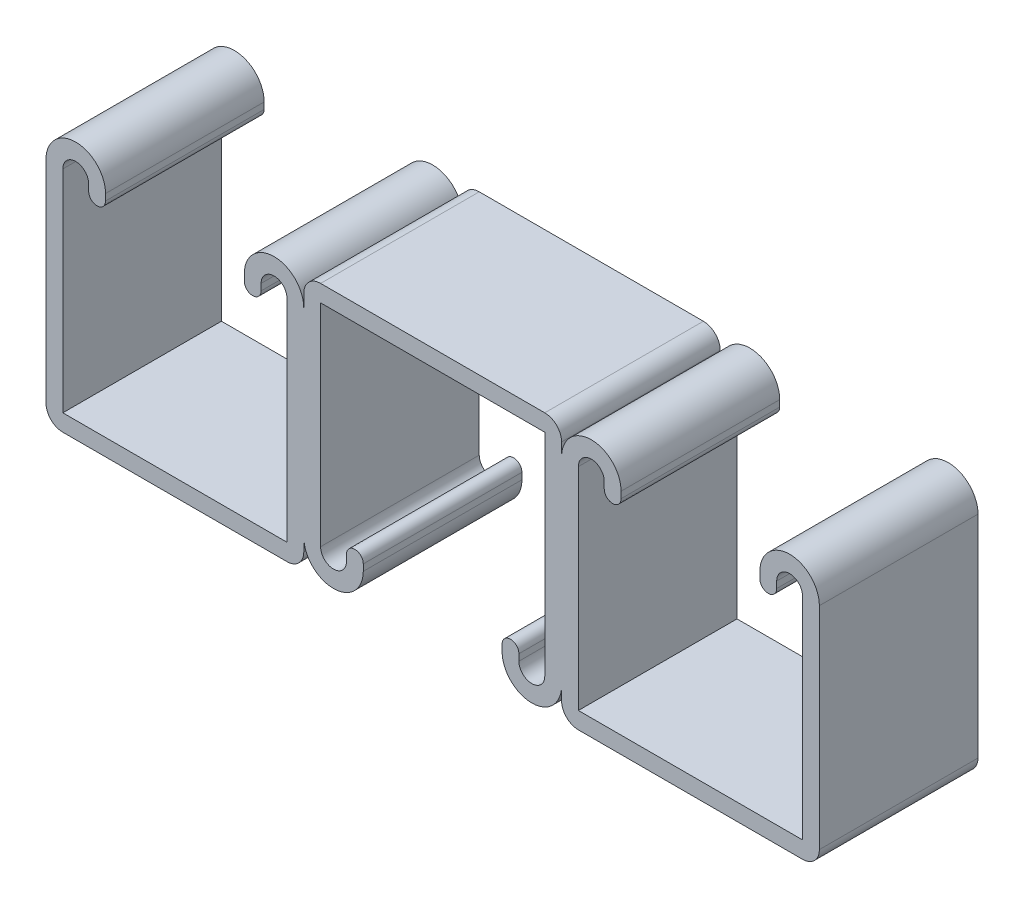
from build123d import *

# Parameters (mm, degrees)
BASE_EXTRUDE_DEPTH = 12.7
CIRPATTERN1_COUNT  = 2
LPATTERN1_COUNT    = 2
LPATTERN1_PITCH    = 82.55


with BuildPart() as part:
    # Sketch1 → Base-Extrude (new, symmetric)
    with BuildSketch(Plane.XY):
        with BuildLine():
            Line((-41.275, 15.875), (-41.275, -17.9451))
            ThreePointArc((-41.275, -17.9451), (-40.486414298, -19.848914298), (-38.5826, -20.6375))
            Line((-38.5826, -20.6375), (-2.6924, -20.6375))
            ThreePointArc((-2.6924, -20.6375), (-0.788585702, -19.848914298), (0, -17.9451))
            Line((0, -17.9451), (0, 15.875))
            ThreePointArc((0, 15.875), (-4.7625, 20.6375), (-9.525, 15.875))
            Line((-9.525, 15.875), (-9.525, 14.83995))
            ThreePointArc((-9.525, 14.83995), (-8.1788, 13.49375), (-6.8326, 14.83995))
            Line((-6.8326, 14.83995), (-6.8326, 15.875))
            ThreePointArc((-6.8326, 15.875), (-4.7625, 17.9451), (-2.6924, 15.875))
            Line((-2.6924, 15.875), (-2.6924, -17.9451))
            Line((-2.6924, -17.9451), (-38.5826, -17.9451))
            Line((-38.5826, -17.9451), (-38.5826, 15.875))
            ThreePointArc((-38.5826, 15.875), (-36.5125, 17.9451), (-34.4424, 15.875))
            Line((-34.4424, 15.875), (-34.4424, 14.83995))
            ThreePointArc((-34.4424, 14.83995), (-33.0962, 13.49375), (-31.75, 14.83995))
            Line((-31.75, 14.83995), (-31.75, 15.875))
            ThreePointArc((-31.75, 15.875), (-36.5125, 20.6375), (-41.275, 15.875))
        make_face()
    base_extrude = extrude(amount=BASE_EXTRUDE_DEPTH, both=True)

    # CirPattern1: Base-Extrude ×2 about axis
    cirpattern1_axis = Axis((0, 0, 0), (0, 0, 1))
    for i in range(1, CIRPATTERN1_COUNT):
        add(base_extrude.rotate(cirpattern1_axis, i * 360 / CIRPATTERN1_COUNT))

    # LPattern1: Base-Extrude ×2
    with Locations(*[(i * LPATTERN1_PITCH, 0, 0) for i in range(1, LPATTERN1_COUNT)]):
        add(base_extrude)


solid = part.part
